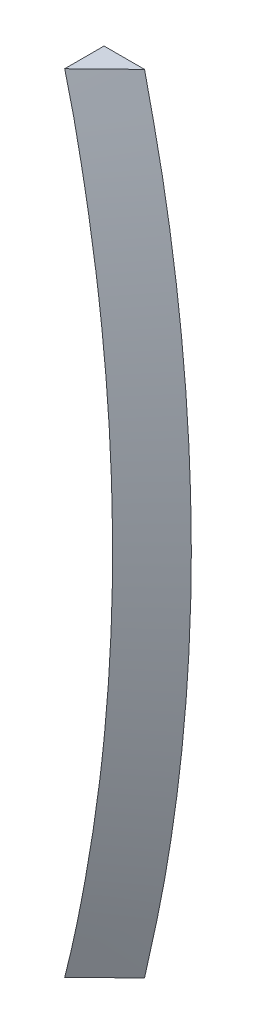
ISO-10303-21;
HEADER;
FILE_DESCRIPTION(('STEP AP214'),'2;1');
FILE_NAME('part.step','',(''),(''),'','','');
FILE_SCHEMA(('AUTOMOTIVE_DESIGN { 1 0 10303 214 1 1 1 1 }'));
ENDSEC;
DATA;
#1=APPLICATION_CONTEXT('core data for automotive mechanical design processes');
#2=APPLICATION_PROTOCOL_DEFINITION('international standard','automotive_design',2000,#1);
#3=PRODUCT_CONTEXT('',#1,'mechanical');
#4=PRODUCT('Part','Part','',(#3));
#5=PRODUCT_RELATED_PRODUCT_CATEGORY('part','',(#4));
#6=PRODUCT_DEFINITION_FORMATION('','',#4);
#7=PRODUCT_DEFINITION_CONTEXT('part definition',#1,'design');
#8=PRODUCT_DEFINITION('design','',#6,#7);
#9=PRODUCT_DEFINITION_SHAPE('','',#8);
#10=(LENGTH_UNIT() NAMED_UNIT(*) SI_UNIT(.MILLI.,.METRE.));
#11=(NAMED_UNIT(*) PLANE_ANGLE_UNIT() SI_UNIT($,.RADIAN.));
#12=(NAMED_UNIT(*) SI_UNIT($,.STERADIAN.) SOLID_ANGLE_UNIT());
#13=UNCERTAINTY_MEASURE_WITH_UNIT(LENGTH_MEASURE(1.E-05),#10,'distance_accuracy_value','');
#14=(GEOMETRIC_REPRESENTATION_CONTEXT(3) GLOBAL_UNCERTAINTY_ASSIGNED_CONTEXT((#13)) GLOBAL_UNIT_ASSIGNED_CONTEXT((#10,
#11,#12)) REPRESENTATION_CONTEXT('',''));
#15=CARTESIAN_POINT('',(0.,0.,0.));
#16=DIRECTION('',(0.,0.,1.));
#17=DIRECTION('',(1.,0.,0.));
#18=AXIS2_PLACEMENT_3D('',#15,#16,#17);
#19=CARTESIAN_POINT('',(0.,0.,15.));
#20=DIRECTION('',(0.,0.,1.));
#21=DIRECTION('',(1.,0.,0.));
#22=AXIS2_PLACEMENT_3D('',#19,#20,#21);
#23=PLANE('',#22);
#24=CARTESIAN_POINT('',(124.434721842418,-30.,15.));
#25=CARTESIAN_POINT('',(124.540839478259,-29.5286219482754,15.));
#26=CARTESIAN_POINT('',(124.646959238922,-29.0572394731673,15.));
#27=CARTESIAN_POINT('',(124.857718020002,-28.1140839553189,15.));
#28=CARTESIAN_POINT('',(124.962356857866,-27.6423108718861,15.));
#29=CARTESIAN_POINT('',(125.168643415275,-26.6981016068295,15.));
#30=CARTESIAN_POINT('',(125.270291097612,-26.2256654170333,15.));
#31=CARTESIAN_POINT('',(125.469118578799,-25.2796676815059,15.));
#32=CARTESIAN_POINT('',(125.566296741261,-24.8061057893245,15.));
#33=CARTESIAN_POINT('',(125.707531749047,-24.0948755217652,15.));
#34=CARTESIAN_POINT('',(125.753853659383,-23.8576565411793,15.));
#35=CARTESIAN_POINT('',(125.844796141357,-23.3828931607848,15.));
#36=CARTESIAN_POINT('',(125.889416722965,-23.1453487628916,15.));
#37=CARTESIAN_POINT('',(125.954922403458,-22.7887676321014,15.));
#38=CARTESIAN_POINT('',(125.976520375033,-22.6698615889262,15.));
#39=CARTESIAN_POINT('',(126.01922450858,-22.4319612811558,15.));
#40=CARTESIAN_POINT('',(126.040330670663,-22.3129670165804,15.));
#41=CARTESIAN_POINT('',(126.082182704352,-22.074913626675,15.));
#42=CARTESIAN_POINT('',(126.102928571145,-21.9558545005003,15.));
#43=CARTESIAN_POINT('',(126.144096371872,-21.7176800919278,15.));
#44=CARTESIAN_POINT('',(126.164518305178,-21.5985648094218,15.));
#45=CARTESIAN_POINT('',(126.245688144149,-21.1211315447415,15.));
#46=CARTESIAN_POINT('',(126.305101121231,-20.762585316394,15.));
#47=CARTESIAN_POINT('',(126.420915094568,-20.0450074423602,15.));
#48=CARTESIAN_POINT('',(126.477316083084,-19.6859757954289,15.));
#49=CARTESIAN_POINT('',(126.64197248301,-18.6081799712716,15.));
#50=CARTESIAN_POINT('',(126.745681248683,-17.8887153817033,15.));
#51=CARTESIAN_POINT('',(126.940812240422,-16.4480256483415,15.));
#52=CARTESIAN_POINT('',(127.032232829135,-15.7268002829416,15.));
#53=CARTESIAN_POINT('',(127.202703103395,-14.2828847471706,15.));
#54=CARTESIAN_POINT('',(127.281752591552,-13.5601945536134,15.));
#55=CARTESIAN_POINT('',(127.500451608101,-11.3901042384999,15.));
#56=CARTESIAN_POINT('',(127.621636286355,-9.94079823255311,15.));
#57=CARTESIAN_POINT('',(127.814526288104,-7.03902573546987,15.));
#58=CARTESIAN_POINT('',(127.886235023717,-5.58655946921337,15.));
#59=CARTESIAN_POINT('',(127.979063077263,-2.71304272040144,15.));
#60=CARTESIAN_POINT('',(128.001294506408,-1.29202803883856,15.));
#61=CARTESIAN_POINT('',(127.998430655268,1.55001437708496,15.));
#62=CARTESIAN_POINT('',(127.973334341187,2.9710421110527,15.));
#63=CARTESIAN_POINT('',(127.900219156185,5.10125734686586,15.));
#64=CARTESIAN_POINT('',(127.86993644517,5.81109617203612,15.));
#65=CARTESIAN_POINT('',(127.797555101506,7.23018091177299,15.));
#66=CARTESIAN_POINT('',(127.755456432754,7.9394268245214,15.));
#67=CARTESIAN_POINT('',(127.659457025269,9.35711461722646,15.));
#68=CARTESIAN_POINT('',(127.605556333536,10.0655565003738,15.));
#69=CARTESIAN_POINT('',(127.485962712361,11.4814386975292,15.));
#70=CARTESIAN_POINT('',(127.420269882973,12.1888790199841,15.));
#71=CARTESIAN_POINT('',(127.275826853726,13.615496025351,15.));
#72=CARTESIAN_POINT('',(127.196859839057,14.3346507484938,15.));
#73=CARTESIAN_POINT('',(127.026667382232,15.7715294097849,15.));
#74=CARTESIAN_POINT('',(126.935441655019,16.4892533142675,15.));
#75=CARTESIAN_POINT('',(126.789465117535,17.5645966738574,15.));
#76=CARTESIAN_POINT('',(126.739282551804,17.9228421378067,15.));
#77=CARTESIAN_POINT('',(126.635896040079,18.638897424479,15.));
#78=CARTESIAN_POINT('',(126.582692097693,18.996707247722,15.));
#79=CARTESIAN_POINT('',(126.473281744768,19.711850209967,15.));
#80=CARTESIAN_POINT('',(126.417075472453,20.069183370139,15.));
#81=CARTESIAN_POINT('',(126.301680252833,20.7833693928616,15.));
#82=CARTESIAN_POINT('',(126.242491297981,21.1402222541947,15.));
#83=CARTESIAN_POINT('',(126.161587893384,21.6156969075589,15.));
#84=CARTESIAN_POINT('',(126.141195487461,21.7345447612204,15.));
#85=CARTESIAN_POINT('',(126.100089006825,21.9721848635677,15.));
#86=CARTESIAN_POINT('',(126.079374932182,22.0909771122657,15.));
#87=CARTESIAN_POINT('',(126.037582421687,22.3284967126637,15.));
#88=CARTESIAN_POINT('',(126.016503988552,22.4472240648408,15.));
#89=CARTESIAN_POINT('',(125.973854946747,22.6845902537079,15.));
#90=CARTESIAN_POINT('',(125.952284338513,22.8032290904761,15.));
#91=CARTESIAN_POINT('',(125.886864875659,23.1590171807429,15.));
#92=CARTESIAN_POINT('',(125.842308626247,23.3960366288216,15.));
#93=CARTESIAN_POINT('',(125.751504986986,23.8697518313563,15.));
#94=CARTESIAN_POINT('',(125.705257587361,24.1064475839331,15.));
#95=CARTESIAN_POINT('',(125.564259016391,24.8161189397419,15.));
#96=CARTESIAN_POINT('',(125.467257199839,25.2886477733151,15.));
#97=CARTESIAN_POINT('',(125.268777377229,26.2327415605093,15.));
#98=CARTESIAN_POINT('',(125.167299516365,26.7043065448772,15.));
#99=CARTESIAN_POINT('',(124.961371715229,27.6467657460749,15.));
#100=CARTESIAN_POINT('',(124.856921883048,28.1176599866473,15.));
#101=CARTESIAN_POINT('',(124.646554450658,29.0590375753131,15.));
#102=CARTESIAN_POINT('',(124.540637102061,29.5295209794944,15.));
#103=CARTESIAN_POINT('',(124.434721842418,30.,15.));
#104=B_SPLINE_CURVE_WITH_KNOTS('',3,(#24,#25,#26,#27,#28,#29,#30,#31,#32,#33,#34,#35,#36,#37,
#38,#39,#40,#41,#42,#43,#44,#45,#46,#47,#48,#49,#50,#51,#52,#53,#54,#55,#56,#57,#58,#59,#60,#61,
#62,#63,#64,#65,#66,#67,#68,#69,#70,#71,#72,#73,#74,#75,#76,#77,#78,#79,#80,#81,#82,#83,#84,#85,
#86,#87,#88,#89,#90,#91,#92,#93,#94,#95,#96,#97,#98,#99,#100,#101,#102,#103),.UNSPECIFIED.,.F.,
.F.,(4,2,2,2,2,2,2,2,2,2,2,2,2,2,2,2,2,2,2,2,2,2,2,2,2,2,2,2,2,2,2,2,2,2,2,2,2,2,2,4),(0.,
1.449533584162,2.89924432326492,4.34897308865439,5.79922847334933,6.52432150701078,
7.24941029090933,7.61196429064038,7.9745182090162,8.33707696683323,8.69963642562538,
9.78992763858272,10.8802216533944,13.060811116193,15.2416908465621,17.4226053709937,
21.7847789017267,26.146651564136,30.4094468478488,34.6723352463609,36.8037081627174,
38.9350875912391,41.0664585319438,43.1978113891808,45.3681409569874,47.5385210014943,
48.6237399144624,49.7089575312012,50.7941252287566,51.8792956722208,52.2410493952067,
52.6028030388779,52.9645539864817,53.3263046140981,54.0498100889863,54.7733197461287,
56.2204332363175,57.6674998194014,59.1145138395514,60.5612827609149),.UNSPECIFIED.);
#105=CARTESIAN_POINT('',(124.434721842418,-30.,15.));
#106=VERTEX_POINT('',#105);
#107=CARTESIAN_POINT('',(124.434721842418,30.,15.));
#108=VERTEX_POINT('',#107);
#109=EDGE_CURVE('E39',#106,#108,#104,.T.);
#110=ORIENTED_EDGE('',*,*,#109,.F.);
#111=DIRECTION('',(1.,0.,0.));
#112=VECTOR('',#111,1.);
#113=CARTESIAN_POINT('',(51.9615242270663,-30.,15.));
#114=LINE('',#113,#112);
#115=CARTESIAN_POINT('',(121.346610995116,-30.,15.));
#116=VERTEX_POINT('',#115);
#117=EDGE_CURVE('E134',#116,#106,#114,.T.);
#118=ORIENTED_EDGE('',*,*,#117,.F.);
#119=CARTESIAN_POINT('',(0.,0.,15.));
#120=DIRECTION('',(0.,0.,1.));
#121=DIRECTION('',(1.,0.,0.));
#122=AXIS2_PLACEMENT_3D('',#119,#120,#121);
#123=CIRCLE('',#122,125.);
#124=CARTESIAN_POINT('',(121.346610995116,30.,15.));
#125=VERTEX_POINT('',#124);
#126=EDGE_CURVE('E69',#116,#125,#123,.T.);
#127=ORIENTED_EDGE('',*,*,#126,.T.);
#128=DIRECTION('',(-1.,0.,0.));
#129=VECTOR('',#128,1.);
#130=CARTESIAN_POINT('',(51.9615242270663,30.,15.));
#131=LINE('',#130,#129);
#132=EDGE_CURVE('E72',#108,#125,#131,.T.);
#133=ORIENTED_EDGE('',*,*,#132,.F.);
#134=EDGE_LOOP('',(#110,#118,#127,#133));
#135=FACE_BOUND('',#134,.T.);
#136=ADVANCED_FACE('F32',(#135),#23,.F.);
#137=CARTESIAN_POINT('',(121.346610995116,-30.,15.));
#138=DIRECTION('',(0.,1.,0.));
#139=DIRECTION('',(-1.,0.,0.));
#140=AXIS2_PLACEMENT_3D('',#137,#138,#139);
#141=PLANE('',#140);
#142=DIRECTION('',(0.,0.,-1.));
#143=VECTOR('',#142,1.);
#144=CARTESIAN_POINT('',(121.346610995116,-30.,15.));
#145=LINE('',#144,#143);
#146=CARTESIAN_POINT('',(121.346610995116,-30.,18.));
#147=VERTEX_POINT('',#146);
#148=EDGE_CURVE('E133',#116,#147,#145,.F.);
#149=ORIENTED_EDGE('',*,*,#148,.F.);
#150=ORIENTED_EDGE('',*,*,#117,.T.);
#151=DIRECTION('',(-0.717265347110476,0.,0.696800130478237));
#152=VECTOR('',#151,1.);
#153=CARTESIAN_POINT('',(124.434721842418,-30.,15.));
#154=LINE('',#153,#152);
#155=EDGE_CURVE('E82',#147,#106,#154,.F.);
#156=ORIENTED_EDGE('',*,*,#155,.F.);
#157=EDGE_LOOP('',(#149,#150,#156));
#158=FACE_BOUND('',#157,.T.);
#159=ADVANCED_FACE('F93',(#158),#141,.F.);
#160=CARTESIAN_POINT('',(0.,0.,25.));
#161=DIRECTION('',(0.,0.,-1.));
#162=DIRECTION('',(-1.,0.,0.));
#163=AXIS2_PLACEMENT_3D('',#160,#161,#162);
#164=CYLINDRICAL_SURFACE('',#163,125.);
#165=DIRECTION('',(0.,0.,-1.));
#166=VECTOR('',#165,1.);
#167=CARTESIAN_POINT('',(121.346610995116,30.,18.));
#168=LINE('',#167,#166);
#169=CARTESIAN_POINT('',(121.346610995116,30.,18.));
#170=VERTEX_POINT('',#169);
#171=EDGE_CURVE('E76',#170,#125,#168,.T.);
#172=ORIENTED_EDGE('',*,*,#171,.T.);
#173=ORIENTED_EDGE('',*,*,#126,.F.);
#174=ORIENTED_EDGE('',*,*,#148,.T.);
#175=CARTESIAN_POINT('',(121.346610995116,30.,18.));
#176=CARTESIAN_POINT('',(121.461504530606,29.535270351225,17.9925875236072));
#177=CARTESIAN_POINT('',(121.573734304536,29.0698532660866,17.987909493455));
#178=CARTESIAN_POINT('',(121.792836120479,28.1377720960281,17.982519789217));
#179=CARTESIAN_POINT('',(121.899708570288,27.6711081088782,17.9818078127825));
#180=CARTESIAN_POINT('',(122.108082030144,26.7365947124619,17.9828470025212));
#181=CARTESIAN_POINT('',(122.209583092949,26.2687453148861,17.9845981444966));
#182=CARTESIAN_POINT('',(122.407234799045,25.3317624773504,17.9890278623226));
#183=CARTESIAN_POINT('',(122.50338369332,24.8626286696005,17.991706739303));
#184=CARTESIAN_POINT('',(122.643559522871,24.1581175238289,17.9952600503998));
#185=CARTESIAN_POINT('',(122.689610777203,23.9231423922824,17.9963669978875));
#186=CARTESIAN_POINT('',(122.780362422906,23.4529302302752,17.9982300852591));
#187=CARTESIAN_POINT('',(122.825062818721,23.217693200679,17.9989862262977));
#188=CARTESIAN_POINT('',(122.891099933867,22.8646428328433,17.9997171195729));
#189=CARTESIAN_POINT('',(122.91294382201,22.7469245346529,17.9998935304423));
#190=CARTESIAN_POINT('',(122.956293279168,22.5114254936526,18.0000790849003));
#191=CARTESIAN_POINT('',(122.977798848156,22.3936447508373,18.0000882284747));
#192=CARTESIAN_POINT('',(123.020471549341,22.158021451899,18.0000517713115));
#193=CARTESIAN_POINT('',(123.04163868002,22.0401788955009,18.0000061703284));
#194=CARTESIAN_POINT('',(123.083634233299,21.8044334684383,17.9999319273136));
#195=CARTESIAN_POINT('',(123.104462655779,21.6865305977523,17.9999032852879));
#196=CARTESIAN_POINT('',(123.187218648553,21.2141149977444,17.9997991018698));
#197=CARTESIAN_POINT('',(123.24778498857,20.8593626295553,17.9997447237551));
#198=CARTESIAN_POINT('',(123.365851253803,20.1493488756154,17.9996840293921));
#199=CARTESIAN_POINT('',(123.423351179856,19.7940874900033,17.9996777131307));
#200=CARTESIAN_POINT('',(123.535281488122,19.0830748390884,17.9996934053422));
#201=CARTESIAN_POINT('',(123.58971181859,18.7273235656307,17.9997154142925));
#202=CARTESIAN_POINT('',(123.695498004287,18.0153628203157,17.9997749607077));
#203=CARTESIAN_POINT('',(123.746853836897,17.6591533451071,17.9998124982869));
#204=CARTESIAN_POINT('',(123.896307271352,16.589850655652,17.9999176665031));
#205=CARTESIAN_POINT('',(123.989787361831,15.8761050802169,17.9999778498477));
#206=CARTESIAN_POINT('',(124.164404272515,14.4471067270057,18.0000172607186));
#207=CARTESIAN_POINT('',(124.245540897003,13.7318539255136,17.9999964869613));
#208=CARTESIAN_POINT('',(124.470417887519,11.5839521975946,17.9999590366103));
#209=CARTESIAN_POINT('',(124.595603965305,10.1493131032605,17.9999672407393));
#210=CARTESIAN_POINT('',(124.796330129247,7.27662183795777,17.9999674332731));
#211=CARTESIAN_POINT('',(124.871871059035,5.83856972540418,17.9999594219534));
#212=CARTESIAN_POINT('',(124.972940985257,2.96881127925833,17.9999489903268));
#213=CARTESIAN_POINT('',(124.998748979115,1.53711476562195,17.999946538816));
#214=CARTESIAN_POINT('',(125.00116218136,-1.32635482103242,17.9999467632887));
#215=CARTESIAN_POINT('',(124.977767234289,-2.758127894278,17.9999494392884));
#216=CARTESIAN_POINT('',(124.905800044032,-4.90444904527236,17.999955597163));
#217=CARTESIAN_POINT('',(124.875665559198,-5.61966085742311,17.9999580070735));
#218=CARTESIAN_POINT('',(124.80311435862,-7.0494692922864,17.9999622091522));
#219=CARTESIAN_POINT('',(124.760697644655,-7.76406591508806,17.9999640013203));
#220=CARTESIAN_POINT('',(124.663594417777,-9.19242337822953,17.999968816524));
#221=CARTESIAN_POINT('',(124.608907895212,-9.90618421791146,17.9999718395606));
#222=CARTESIAN_POINT('',(124.48728116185,-11.3326622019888,17.9999740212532));
#223=CARTESIAN_POINT('',(124.420340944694,-12.0453793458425,17.9999731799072));
#224=CARTESIAN_POINT('',(124.272801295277,-13.4834513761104,17.9999918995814));
#225=CARTESIAN_POINT('',(124.19196084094,-14.2087815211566,18.0000118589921));
#226=CARTESIAN_POINT('',(124.017588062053,-15.6579195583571,17.9999840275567));
#227=CARTESIAN_POINT('',(123.924055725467,-16.3817274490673,17.9999362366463));
#228=CARTESIAN_POINT('',(123.774261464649,-17.4661202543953,17.9998331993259));
#229=CARTESIAN_POINT('',(123.722747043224,-17.8273670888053,17.9997936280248));
#230=CARTESIAN_POINT('',(123.616556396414,-18.5493971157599,17.9997282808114));
#231=CARTESIAN_POINT('',(123.56188016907,-18.910180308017,17.9997025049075));
#232=CARTESIAN_POINT('',(123.449370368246,-19.6312533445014,17.9996779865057));
#233=CARTESIAN_POINT('',(123.391536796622,-19.9915431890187,17.9996792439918));
#234=CARTESIAN_POINT('',(123.272716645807,-20.7116025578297,17.9997269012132));
#235=CARTESIAN_POINT('',(123.211730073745,-21.0713720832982,17.9997733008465));
#236=CARTESIAN_POINT('',(123.128313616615,-21.5507119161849,17.9998715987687));
#237=CARTESIAN_POINT('',(123.10728273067,-21.6705269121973,17.9998992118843));
#238=CARTESIAN_POINT('',(123.06487124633,-21.9100950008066,17.9999655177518));
#239=CARTESIAN_POINT('',(123.043490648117,-22.0298480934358,18.0000042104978));
#240=CARTESIAN_POINT('',(123.000379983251,-22.2692910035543,18.0000727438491));
#241=CARTESIAN_POINT('',(122.978649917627,-22.3889808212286,18.0001025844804));
#242=CARTESIAN_POINT('',(122.934840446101,-22.628296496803,18.0000097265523));
#243=CARTESIAN_POINT('',(122.91276104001,-22.7479223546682,17.9998870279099));
#244=CARTESIAN_POINT('',(122.845999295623,-23.1067013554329,17.9992912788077));
#245=CARTESIAN_POINT('',(122.80079325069,-23.3457569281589,17.9985905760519));
#246=CARTESIAN_POINT('',(122.708986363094,-23.8235987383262,17.9968027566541));
#247=CARTESIAN_POINT('',(122.662385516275,-24.0623849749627,17.9957156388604));
#248=CARTESIAN_POINT('',(122.52049329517,-24.7783267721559,17.9921736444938));
#249=CARTESIAN_POINT('',(122.423111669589,-25.2550684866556,17.9894381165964));
#250=CARTESIAN_POINT('',(122.222786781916,-26.2073874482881,17.9848470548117));
#251=CARTESIAN_POINT('',(122.119843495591,-26.6829646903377,17.9829915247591));
#252=CARTESIAN_POINT('',(121.908409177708,-27.6328884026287,17.9817733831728));
#253=CARTESIAN_POINT('',(121.799918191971,-28.1072348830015,17.9824107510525));
#254=CARTESIAN_POINT('',(121.577405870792,-29.0546241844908,17.9877569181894));
#255=CARTESIAN_POINT('',(121.463384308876,-29.5276669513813,17.9924658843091));
#256=CARTESIAN_POINT('',(121.346610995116,-30.,18.));
#257=B_SPLINE_CURVE_WITH_KNOTS('',3,(#175,#176,#177,#178,#179,#180,#181,#182,#183,#184,#185,
#186,#187,#188,#189,#190,#191,#192,#193,#194,#195,#196,#197,#198,#199,#200,#201,#202,#203,#204,
#205,#206,#207,#208,#209,#210,#211,#212,#213,#214,#215,#216,#217,#218,#219,#220,#221,#222,#223,
#224,#225,#226,#227,#228,#229,#230,#231,#232,#233,#234,#235,#236,#237,#238,#239,#240,#241,#242,
#243,#244,#245,#246,#247,#248,#249,#250,#251,#252,#253,#254,#255,#256),.UNSPECIFIED.,.F.,.F.,(4,
2,2,2,2,2,2,2,2,2,2,2,2,2,2,2,2,2,2,2,2,2,2,2,2,2,2,2,2,2,2,2,2,2,2,2,2,2,2,2,4),(0.,
1.43630066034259,2.87249182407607,4.30866887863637,5.74531253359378,6.46365273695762,
7.18199057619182,7.54117395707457,7.90035736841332,8.25954239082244,8.61872754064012,
9.69836872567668,10.7780096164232,11.8576687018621,12.9373357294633,15.0967362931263,
17.2561710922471,21.575504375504,25.8947642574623,30.1897221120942,34.484693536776,
36.6321462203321,38.7795985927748,40.9270526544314,43.0745078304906,45.2638619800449,
47.4532182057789,48.5479109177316,49.6426043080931,50.7372970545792,51.8319873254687,
52.1969272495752,52.5618669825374,52.9268056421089,53.2917445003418,54.0216191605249,
54.7514959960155,56.2112403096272,57.6709909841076,59.1307296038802,60.5905280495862),.UNSPECIFIED.);
#258=EDGE_CURVE('E49',#170,#147,#257,.T.);
#259=ORIENTED_EDGE('',*,*,#258,.F.);
#260=EDGE_LOOP('',(#172,#173,#174,#259));
#261=FACE_BOUND('',#260,.T.);
#262=ADVANCED_FACE('F89',(#261),#164,.F.);
#263=CARTESIAN_POINT('',(121.346610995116,30.,15.));
#264=DIRECTION('',(0.,1.,0.));
#265=DIRECTION('',(0.,0.,1.));
#266=AXIS2_PLACEMENT_3D('',#263,#264,#265);
#267=PLANE('',#266);
#268=ORIENTED_EDGE('',*,*,#171,.F.);
#269=DIRECTION('',(0.717265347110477,0.,-0.696800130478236));
#270=VECTOR('',#269,1.);
#271=CARTESIAN_POINT('',(121.346610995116,30.,18.));
#272=LINE('',#271,#270);
#273=EDGE_CURVE('E11',#108,#170,#272,.F.);
#274=ORIENTED_EDGE('',*,*,#273,.F.);
#275=ORIENTED_EDGE('',*,*,#132,.T.);
#276=EDGE_LOOP('',(#268,#274,#275));
#277=FACE_BOUND('',#276,.T.);
#278=ADVANCED_FACE('F78',(#277),#267,.T.);
#279=CARTESIAN_POINT('',(124.434721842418,30.,15.));
#280=CARTESIAN_POINT('',(124.989401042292,27.5361113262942,15.));
#281=CARTESIAN_POINT('',(125.583807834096,24.8957524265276,15.));
#282=CARTESIAN_POINT('',(126.462154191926,19.9270632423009,15.));
#283=CARTESIAN_POINT('',(126.846776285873,17.3110384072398,15.));
#284=CARTESIAN_POINT('',(127.414164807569,12.4782997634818,15.));
#285=CARTESIAN_POINT('',(127.854350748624,7.44724965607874,15.));
#286=CARTESIAN_POINT('',(128.072747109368,0.0599926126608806,15.));
#287=CARTESIAN_POINT('',(127.857812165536,-7.38725701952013,15.));
#288=CARTESIAN_POINT('',(127.421171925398,-12.418616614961,15.));
#289=CARTESIAN_POINT('',(126.846776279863,-17.3110384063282,15.));
#290=CARTESIAN_POINT('',(126.4621541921,-19.9270632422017,15.));
#291=CARTESIAN_POINT('',(125.583807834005,-24.8957524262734,15.));
#292=CARTESIAN_POINT('',(124.989401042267,-27.5361113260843,15.));
#293=CARTESIAN_POINT('',(124.434721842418,-30.,15.));
#294=CARTESIAN_POINT('',(123.405351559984,30.,16.));
#295=CARTESIAN_POINT('',(123.964601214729,27.5365825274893,16.));
#296=CARTESIAN_POINT('',(124.563905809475,24.8967285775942,16.));
#297=CARTESIAN_POINT('',(125.449489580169,19.9284138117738,16.));
#298=CARTESIAN_POINT('',(125.837280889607,17.312422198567,16.));
#299=CARTESIAN_POINT('',(126.409344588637,12.4795339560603,16.));
#300=CARTESIAN_POINT('',(126.853157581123,7.44811373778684,16.));
#301=CARTESIAN_POINT('',(127.073353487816,0.0599995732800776,16.));
#302=CARTESIAN_POINT('',(126.856647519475,-7.38811414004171,16.));
#303=CARTESIAN_POINT('',(126.416409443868,-12.419848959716,16.));
#304=CARTESIAN_POINT('',(125.837280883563,-17.3124221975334,16.));
#305=CARTESIAN_POINT('',(125.449489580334,-19.9284138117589,16.));
#306=CARTESIAN_POINT('',(124.56390580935,-24.8967285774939,16.));
#307=CARTESIAN_POINT('',(123.964601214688,-27.5365825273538,16.));
#308=CARTESIAN_POINT('',(123.405351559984,-30.,16.));
#309=CARTESIAN_POINT('',(122.37598127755,30.,17.));
#310=CARTESIAN_POINT('',(122.939801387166,27.5370537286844,17.));
#311=CARTESIAN_POINT('',(123.544003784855,24.8977047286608,17.));
#312=CARTESIAN_POINT('',(124.436824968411,19.9297643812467,17.));
#313=CARTESIAN_POINT('',(124.82778549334,17.3138059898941,17.));
#314=CARTESIAN_POINT('',(125.404524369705,12.4807681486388,17.));
#315=CARTESIAN_POINT('',(125.851964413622,7.44897781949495,17.));
#316=CARTESIAN_POINT('',(126.073959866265,0.0600065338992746,17.));
#317=CARTESIAN_POINT('',(125.855482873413,-7.38897126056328,17.));
#318=CARTESIAN_POINT('',(125.411646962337,-12.421081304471,17.));
#319=CARTESIAN_POINT('',(124.827785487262,-17.3138059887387,17.));
#320=CARTESIAN_POINT('',(124.436824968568,-19.9297643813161,17.));
#321=CARTESIAN_POINT('',(123.544003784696,-24.8977047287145,17.));
#322=CARTESIAN_POINT('',(122.939801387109,-27.5370537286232,17.));
#323=CARTESIAN_POINT('',(122.37598127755,-30.,17.));
#324=CARTESIAN_POINT('',(121.346610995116,30.,18.));
#325=CARTESIAN_POINT('',(121.915001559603,27.5375249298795,18.));
#326=CARTESIAN_POINT('',(122.524101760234,24.8986808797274,18.));
#327=CARTESIAN_POINT('',(123.424160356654,19.9311149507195,18.));
#328=CARTESIAN_POINT('',(123.818290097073,17.3151897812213,18.));
#329=CARTESIAN_POINT('',(124.399704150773,12.4820023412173,18.));
#330=CARTESIAN_POINT('',(124.850771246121,7.44984190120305,18.));
#331=CARTESIAN_POINT('',(125.074566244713,0.0600134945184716,18.));
#332=CARTESIAN_POINT('',(124.854318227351,-7.38982838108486,18.));
#333=CARTESIAN_POINT('',(124.406884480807,-12.422313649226,18.));
#334=CARTESIAN_POINT('',(123.818290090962,-17.3151897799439,18.));
#335=CARTESIAN_POINT('',(123.424160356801,-19.9311149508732,18.));
#336=CARTESIAN_POINT('',(122.524101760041,-24.898680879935,18.));
#337=CARTESIAN_POINT('',(121.91500155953,-27.5375249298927,18.));
#338=CARTESIAN_POINT('',(121.346610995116,-30.,18.));
#339=CARTESIAN_POINT('',(121.336317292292,30.,18.01));
#340=CARTESIAN_POINT('',(121.904753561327,27.5375296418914,18.01));
#341=CARTESIAN_POINT('',(122.513902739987,24.898690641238,18.01));
#342=CARTESIAN_POINT('',(123.414033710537,19.9311284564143,18.01));
#343=CARTESIAN_POINT('',(123.80819514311,17.3152036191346,18.01));
#344=CARTESIAN_POINT('',(124.389655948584,12.4820146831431,18.01));
#345=CARTESIAN_POINT('',(124.840759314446,7.44985054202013,18.01));
#346=CARTESIAN_POINT('',(125.064572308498,0.0600135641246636,18.01));
#347=CARTESIAN_POINT('',(124.844306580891,-7.38983695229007,18.01));
#348=CARTESIAN_POINT('',(124.396836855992,-12.4223259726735,18.01));
#349=CARTESIAN_POINT('',(123.808195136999,-17.315203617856,18.01));
#350=CARTESIAN_POINT('',(123.414033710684,-19.9311284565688,18.01));
#351=CARTESIAN_POINT('',(122.513902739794,-24.8986906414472,18.01));
#352=CARTESIAN_POINT('',(121.904753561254,-27.5375296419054,18.01));
#353=CARTESIAN_POINT('',(121.336317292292,-30.,18.01));
#354=CARTESIAN_POINT('',(121.326023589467,30.,18.02));
#355=CARTESIAN_POINT('',(121.894505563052,27.5375343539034,18.02));
#356=CARTESIAN_POINT('',(122.503703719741,24.8987004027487,18.02));
#357=CARTESIAN_POINT('',(123.403907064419,19.931141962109,18.02));
#358=CARTESIAN_POINT('',(123.798100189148,17.3152174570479,18.02));
#359=CARTESIAN_POINT('',(124.379607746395,12.4820270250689,18.02));
#360=CARTESIAN_POINT('',(124.830747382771,7.44985918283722,18.02));
#361=CARTESIAN_POINT('',(125.054578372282,0.0600136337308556,18.02));
#362=CARTESIAN_POINT('',(124.83429493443,-7.38984552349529,18.02));
#363=CARTESIAN_POINT('',(124.386789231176,-12.4223382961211,18.02));
#364=CARTESIAN_POINT('',(123.798100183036,-17.315217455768,18.02));
#365=CARTESIAN_POINT('',(123.403907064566,-19.9311419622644,18.02));
#366=CARTESIAN_POINT('',(122.503703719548,-24.8987004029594,18.02));
#367=CARTESIAN_POINT('',(121.894505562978,-27.5375343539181,18.02));
#368=CARTESIAN_POINT('',(121.326023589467,-30.,18.02));
#369=CARTESIAN_POINT('',(121.315729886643,30.,18.03));
#370=CARTESIAN_POINT('',(121.884257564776,27.5375390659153,18.03));
#371=CARTESIAN_POINT('',(122.493504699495,24.8987101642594,18.03));
#372=CARTESIAN_POINT('',(123.393780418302,19.9311554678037,18.03));
#373=CARTESIAN_POINT('',(123.788005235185,17.3152312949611,18.03));
#374=CARTESIAN_POINT('',(124.369559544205,12.4820393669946,18.03));
#375=CARTESIAN_POINT('',(124.820735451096,7.4498678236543,18.03));
#376=CARTESIAN_POINT('',(125.044584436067,0.0600137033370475,18.03));
#377=CARTESIAN_POINT('',(124.824283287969,-7.38985409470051,18.03));
#378=CARTESIAN_POINT('',(124.376741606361,-12.4223506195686,18.03));
#379=CARTESIAN_POINT('',(123.788005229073,-17.3152312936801,18.03));
#380=CARTESIAN_POINT('',(123.393780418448,-19.9311554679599,18.03));
#381=CARTESIAN_POINT('',(122.493504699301,-24.8987101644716,18.03));
#382=CARTESIAN_POINT('',(121.884257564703,-27.5375390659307,18.03));
#383=CARTESIAN_POINT('',(121.315729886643,-30.,18.03));
#384=B_SPLINE_SURFACE_WITH_KNOTS('',3,3,((#279,#280,#281,#282,#283,#284,#285,#286,#287,#288,
#289,#290,#291,#292,#293),(#294,#295,#296,#297,#298,#299,#300,#301,#302,#303,#304,#305,#306,
#307,#308),(#309,#310,#311,#312,#313,#314,#315,#316,#317,#318,#319,#320,#321,#322,#323),(#324,
#325,#326,#327,#328,#329,#330,#331,#332,#333,#334,#335,#336,#337,#338),(#339,#340,#341,#342,
#343,#344,#345,#346,#347,#348,#349,#350,#351,#352,#353),(#354,#355,#356,#357,#358,#359,#360,
#361,#362,#363,#364,#365,#366,#367,#368),(#369,#370,#371,#372,#373,#374,#375,#376,#377,#378,
#379,#380,#381,#382,#383)),.UNSPECIFIED.,.F.,.F.,.F.,(4,3,4),(4,1,1,1,1,1,1,1,1,1,1,1,4),(0.,1.,
1.01),(0.,0.124620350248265,0.133545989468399,0.249567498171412,0.255522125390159,
0.374730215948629,0.499999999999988,0.622291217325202,0.744477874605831,0.750432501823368,
0.866454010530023,0.875379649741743,1.),.UNSPECIFIED.);
#385=ORIENTED_EDGE('',*,*,#273,.T.);
#386=ORIENTED_EDGE('',*,*,#258,.T.);
#387=ORIENTED_EDGE('',*,*,#155,.T.);
#388=ORIENTED_EDGE('',*,*,#109,.T.);
#389=EDGE_LOOP('',(#385,#386,#387,#388));
#390=FACE_BOUND('',#389,.T.);
#391=ADVANCED_FACE('F34',(#390),#384,.T.);
#392=CLOSED_SHELL('',(#136,#159,#262,#278,#391));
#393=MANIFOLD_SOLID_BREP('B2',#392);
#394=ADVANCED_BREP_SHAPE_REPRESENTATION('',(#18,#393),#14);
#395=SHAPE_DEFINITION_REPRESENTATION(#9,#394);
ENDSEC;
END-ISO-10303-21;
